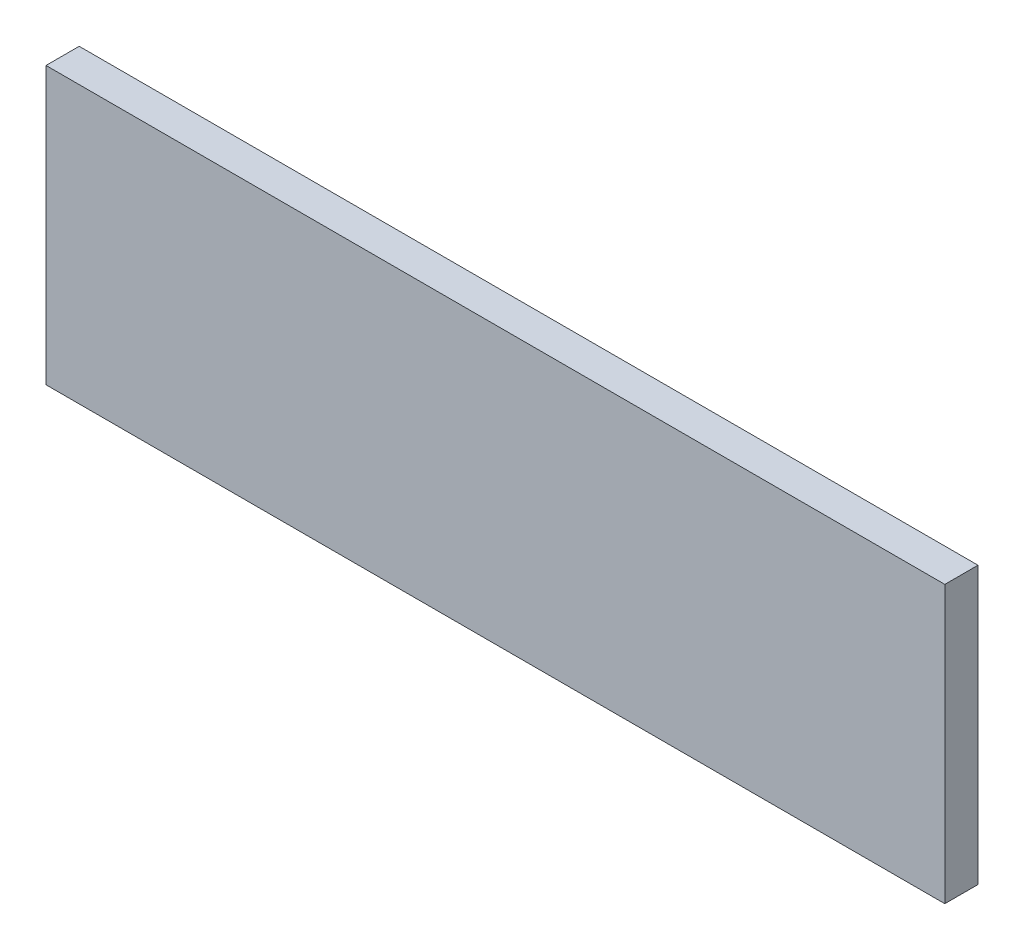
from build123d import *

# Parameters (mm, degrees)
ESQUISSE1_W          = 325
ESQUISSE1_H          = 100
BASE_EXTRUSION_DEPTH = 12


with BuildPart() as part:
    # Esquisse1 → Base-Extrusion (new body)
    with BuildSketch(Plane.XY):
        with Locations((162.5, -50)):
            Rectangle(ESQUISSE1_W, ESQUISSE1_H)
    extrude(amount=BASE_EXTRUSION_DEPTH)


solid = part.part
